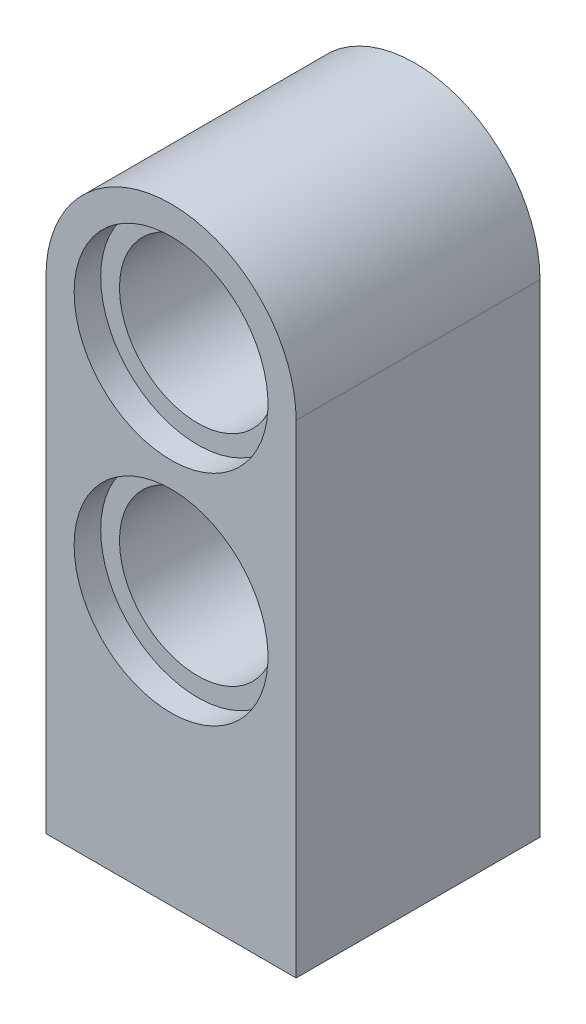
ISO-10303-21;
HEADER;
FILE_DESCRIPTION(('STEP AP214'),'2;1');
FILE_NAME('part.step','',(''),(''),'','','');
FILE_SCHEMA(('AUTOMOTIVE_DESIGN { 1 0 10303 214 1 1 1 1 }'));
ENDSEC;
DATA;
#1=APPLICATION_CONTEXT('core data for automotive mechanical design processes');
#2=APPLICATION_PROTOCOL_DEFINITION('international standard','automotive_design',2000,#1);
#3=PRODUCT_CONTEXT('',#1,'mechanical');
#4=PRODUCT('Part','Part','',(#3));
#5=PRODUCT_RELATED_PRODUCT_CATEGORY('part','',(#4));
#6=PRODUCT_DEFINITION_FORMATION('','',#4);
#7=PRODUCT_DEFINITION_CONTEXT('part definition',#1,'design');
#8=PRODUCT_DEFINITION('design','',#6,#7);
#9=PRODUCT_DEFINITION_SHAPE('','',#8);
#10=(LENGTH_UNIT() NAMED_UNIT(*) SI_UNIT(.MILLI.,.METRE.));
#11=(NAMED_UNIT(*) PLANE_ANGLE_UNIT() SI_UNIT($,.RADIAN.));
#12=(NAMED_UNIT(*) SI_UNIT($,.STERADIAN.) SOLID_ANGLE_UNIT());
#13=UNCERTAINTY_MEASURE_WITH_UNIT(LENGTH_MEASURE(1.E-05),#10,'distance_accuracy_value','');
#14=(GEOMETRIC_REPRESENTATION_CONTEXT(3) GLOBAL_UNCERTAINTY_ASSIGNED_CONTEXT((#13)) GLOBAL_UNIT_ASSIGNED_CONTEXT((#10,
#11,#12)) REPRESENTATION_CONTEXT('',''));
#15=CARTESIAN_POINT('',(0.,0.,0.));
#16=DIRECTION('',(0.,0.,1.));
#17=DIRECTION('',(1.,0.,0.));
#18=AXIS2_PLACEMENT_3D('',#15,#16,#17);
#19=CARTESIAN_POINT('',(0.,9.,3.9));
#20=DIRECTION('',(0.,0.,1.));
#21=DIRECTION('',(1.,0.,0.));
#22=AXIS2_PLACEMENT_3D('',#19,#20,#21);
#23=PLANE('',#22);
#24=CARTESIAN_POINT('',(0.,9.,3.9));
#25=DIRECTION('',(0.,0.,-1.));
#26=DIRECTION('',(-1.,0.,0.));
#27=AXIS2_PLACEMENT_3D('',#24,#25,#26);
#28=CIRCLE('',#27,3.1);
#29=CARTESIAN_POINT('',(-3.1,9.,3.9));
#30=VERTEX_POINT('',#29);
#31=EDGE_CURVE('E221',#30,#30,#28,.T.);
#32=ORIENTED_EDGE('',*,*,#31,.T.);
#33=EDGE_LOOP('',(#32));
#34=FACE_BOUND('',#33,.T.);
#35=CARTESIAN_POINT('',(0.,2.,3.9));
#36=DIRECTION('',(0.,0.,-1.));
#37=DIRECTION('',(-1.,0.,0.));
#38=AXIS2_PLACEMENT_3D('',#35,#36,#37);
#39=CIRCLE('',#38,3.1);
#40=CARTESIAN_POINT('',(-3.1,2.,3.9));
#41=VERTEX_POINT('',#40);
#42=EDGE_CURVE('E218',#41,#41,#39,.T.);
#43=ORIENTED_EDGE('',*,*,#42,.T.);
#44=EDGE_LOOP('',(#43));
#45=FACE_BOUND('',#44,.T.);
#46=DIRECTION('',(0.,-1.,0.));
#47=VECTOR('',#46,1.);
#48=CARTESIAN_POINT('',(-4.,9.,3.9));
#49=LINE('',#48,#47);
#50=CARTESIAN_POINT('',(-4.,9.,3.9));
#51=VERTEX_POINT('',#50);
#52=CARTESIAN_POINT('',(-4.,-6.4432118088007,3.9));
#53=VERTEX_POINT('',#52);
#54=EDGE_CURVE('E105',#51,#53,#49,.T.);
#55=ORIENTED_EDGE('',*,*,#54,.T.);
#56=DIRECTION('',(1.,0.,0.));
#57=VECTOR('',#56,1.);
#58=CARTESIAN_POINT('',(0.,-6.4432118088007,3.9));
#59=LINE('',#58,#57);
#60=CARTESIAN_POINT('',(4.,-6.4432118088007,3.9));
#61=VERTEX_POINT('',#60);
#62=EDGE_CURVE('E95',#53,#61,#59,.T.);
#63=ORIENTED_EDGE('',*,*,#62,.T.);
#64=DIRECTION('',(0.,1.,0.));
#65=VECTOR('',#64,1.);
#66=CARTESIAN_POINT('',(4.,9.,3.9));
#67=LINE('',#66,#65);
#68=CARTESIAN_POINT('',(4.,9.,3.9));
#69=VERTEX_POINT('',#68);
#70=EDGE_CURVE('E103',#61,#69,#67,.T.);
#71=ORIENTED_EDGE('',*,*,#70,.T.);
#72=CARTESIAN_POINT('',(0.,9.,3.9));
#73=DIRECTION('',(0.,0.,1.));
#74=DIRECTION('',(1.,0.,0.));
#75=AXIS2_PLACEMENT_3D('',#72,#73,#74);
#76=CIRCLE('',#75,4.);
#77=EDGE_CURVE('E121',#69,#51,#76,.T.);
#78=ORIENTED_EDGE('',*,*,#77,.T.);
#79=EDGE_LOOP('',(#55,#63,#71,#78));
#80=FACE_BOUND('',#79,.T.);
#81=ADVANCED_FACE('F16',(#34,#45,#80),#23,.T.);
#82=CARTESIAN_POINT('',(0.,9.,-3.9));
#83=DIRECTION('',(0.,0.,1.));
#84=DIRECTION('',(1.,0.,0.));
#85=AXIS2_PLACEMENT_3D('',#82,#83,#84);
#86=PLANE('',#85);
#87=CARTESIAN_POINT('',(0.,2.,-3.9));
#88=DIRECTION('',(0.,0.,-1.));
#89=DIRECTION('',(-1.,0.,0.));
#90=AXIS2_PLACEMENT_3D('',#87,#88,#89);
#91=CIRCLE('',#90,3.1);
#92=CARTESIAN_POINT('',(-3.1,2.,-3.9));
#93=VERTEX_POINT('',#92);
#94=EDGE_CURVE('E154',#93,#93,#91,.T.);
#95=ORIENTED_EDGE('',*,*,#94,.F.);
#96=EDGE_LOOP('',(#95));
#97=FACE_BOUND('',#96,.T.);
#98=CARTESIAN_POINT('',(0.,9.,-3.9));
#99=DIRECTION('',(0.,0.,-1.));
#100=DIRECTION('',(-1.,0.,0.));
#101=AXIS2_PLACEMENT_3D('',#98,#99,#100);
#102=CIRCLE('',#101,3.1);
#103=CARTESIAN_POINT('',(-3.1,9.,-3.9));
#104=VERTEX_POINT('',#103);
#105=EDGE_CURVE('E172',#104,#104,#102,.T.);
#106=ORIENTED_EDGE('',*,*,#105,.F.);
#107=EDGE_LOOP('',(#106));
#108=FACE_BOUND('',#107,.T.);
#109=DIRECTION('',(1.,0.,0.));
#110=VECTOR('',#109,1.);
#111=CARTESIAN_POINT('',(0.,-6.4432118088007,-3.9));
#112=LINE('',#111,#110);
#113=CARTESIAN_POINT('',(-4.,-6.4432118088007,-3.9));
#114=VERTEX_POINT('',#113);
#115=CARTESIAN_POINT('',(4.,-6.4432118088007,-3.9));
#116=VERTEX_POINT('',#115);
#117=EDGE_CURVE('E36',#114,#116,#112,.T.);
#118=ORIENTED_EDGE('',*,*,#117,.F.);
#119=DIRECTION('',(0.,-1.,0.));
#120=VECTOR('',#119,1.);
#121=CARTESIAN_POINT('',(-4.,9.,-3.9));
#122=LINE('',#121,#120);
#123=CARTESIAN_POINT('',(-4.,9.,-3.9));
#124=VERTEX_POINT('',#123);
#125=EDGE_CURVE('E129',#124,#114,#122,.T.);
#126=ORIENTED_EDGE('',*,*,#125,.F.);
#127=CARTESIAN_POINT('',(0.,9.,-3.9));
#128=DIRECTION('',(0.,0.,1.));
#129=DIRECTION('',(1.,0.,0.));
#130=AXIS2_PLACEMENT_3D('',#127,#128,#129);
#131=CIRCLE('',#130,4.);
#132=CARTESIAN_POINT('',(4.,9.,-3.9));
#133=VERTEX_POINT('',#132);
#134=EDGE_CURVE('E125',#133,#124,#131,.T.);
#135=ORIENTED_EDGE('',*,*,#134,.F.);
#136=DIRECTION('',(0.,1.,0.));
#137=VECTOR('',#136,1.);
#138=CARTESIAN_POINT('',(4.,9.,-3.9));
#139=LINE('',#138,#137);
#140=EDGE_CURVE('E134',#116,#133,#139,.T.);
#141=ORIENTED_EDGE('',*,*,#140,.F.);
#142=EDGE_LOOP('',(#118,#126,#135,#141));
#143=FACE_BOUND('',#142,.T.);
#144=ADVANCED_FACE('F242',(#97,#108,#143),#86,.F.);
#145=CARTESIAN_POINT('',(-4.,9.,3.9));
#146=DIRECTION('',(1.,0.,0.));
#147=DIRECTION('',(0.,1.,0.));
#148=AXIS2_PLACEMENT_3D('',#145,#146,#147);
#149=PLANE('',#148);
#150=DIRECTION('',(0.,0.,-1.));
#151=VECTOR('',#150,1.);
#152=CARTESIAN_POINT('',(-4.,-6.4432118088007,3.9));
#153=LINE('',#152,#151);
#154=EDGE_CURVE('E107',#53,#114,#153,.T.);
#155=ORIENTED_EDGE('',*,*,#154,.F.);
#156=ORIENTED_EDGE('',*,*,#54,.F.);
#157=DIRECTION('',(0.,0.,-1.));
#158=VECTOR('',#157,1.);
#159=CARTESIAN_POINT('',(-4.,9.,3.9));
#160=LINE('',#159,#158);
#161=EDGE_CURVE('E25',#51,#124,#160,.T.);
#162=ORIENTED_EDGE('',*,*,#161,.T.);
#163=ORIENTED_EDGE('',*,*,#125,.T.);
#164=EDGE_LOOP('',(#155,#156,#162,#163));
#165=FACE_BOUND('',#164,.T.);
#166=ADVANCED_FACE('F183',(#165),#149,.F.);
#167=CARTESIAN_POINT('',(4.,9.,3.9));
#168=DIRECTION('',(-1.,0.,0.));
#169=DIRECTION('',(0.,-1.,0.));
#170=AXIS2_PLACEMENT_3D('',#167,#168,#169);
#171=PLANE('',#170);
#172=DIRECTION('',(0.,0.,1.));
#173=VECTOR('',#172,1.);
#174=CARTESIAN_POINT('',(4.,-6.4432118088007,3.9));
#175=LINE('',#174,#173);
#176=EDGE_CURVE('E10',#116,#61,#175,.T.);
#177=ORIENTED_EDGE('',*,*,#176,.F.);
#178=ORIENTED_EDGE('',*,*,#140,.T.);
#179=DIRECTION('',(0.,0.,-1.));
#180=VECTOR('',#179,1.);
#181=CARTESIAN_POINT('',(4.,9.,3.9));
#182=LINE('',#181,#180);
#183=EDGE_CURVE('E111',#69,#133,#182,.T.);
#184=ORIENTED_EDGE('',*,*,#183,.F.);
#185=ORIENTED_EDGE('',*,*,#70,.F.);
#186=EDGE_LOOP('',(#177,#178,#184,#185));
#187=FACE_BOUND('',#186,.T.);
#188=ADVANCED_FACE('F109',(#187),#171,.F.);
#189=CARTESIAN_POINT('',(0.,9.,3.9));
#190=DIRECTION('',(0.,0.,-1.));
#191=DIRECTION('',(-1.,0.,0.));
#192=AXIS2_PLACEMENT_3D('',#189,#190,#191);
#193=CYLINDRICAL_SURFACE('',#192,2.5);
#194=CARTESIAN_POINT('',(0.,9.,-3.05));
#195=DIRECTION('',(0.,0.,-1.));
#196=DIRECTION('',(-1.,0.,0.));
#197=AXIS2_PLACEMENT_3D('',#194,#195,#196);
#198=CIRCLE('',#197,2.5);
#199=CARTESIAN_POINT('',(-2.5,9.,-3.05));
#200=VERTEX_POINT('',#199);
#201=EDGE_CURVE('E130',#200,#200,#198,.T.);
#202=ORIENTED_EDGE('',*,*,#201,.T.);
#203=EDGE_LOOP('',(#202));
#204=FACE_BOUND('',#203,.T.);
#205=CARTESIAN_POINT('',(0.,9.,3.05));
#206=DIRECTION('',(0.,0.,1.));
#207=DIRECTION('',(1.,0.,0.));
#208=AXIS2_PLACEMENT_3D('',#205,#206,#207);
#209=CIRCLE('',#208,2.5);
#210=CARTESIAN_POINT('',(2.5,9.,3.05));
#211=VERTEX_POINT('',#210);
#212=EDGE_CURVE('E150',#211,#211,#209,.T.);
#213=ORIENTED_EDGE('',*,*,#212,.T.);
#214=EDGE_LOOP('',(#213));
#215=FACE_BOUND('',#214,.T.);
#216=ADVANCED_FACE('F261',(#204,#215),#193,.F.);
#217=CARTESIAN_POINT('',(0.,2.,3.9));
#218=DIRECTION('',(0.,0.,-1.));
#219=DIRECTION('',(-1.,0.,0.));
#220=AXIS2_PLACEMENT_3D('',#217,#218,#219);
#221=CYLINDRICAL_SURFACE('',#220,2.5);
#222=CARTESIAN_POINT('',(0.,2.,-1.61270993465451));
#223=DIRECTION('',(-0.604572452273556,0.5,0.62007431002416));
#224=DIRECTION('',(-0.477832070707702,0.395181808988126,-0.784543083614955));
#225=AXIS2_PLACEMENT_3D('',#222,#223,#224);
#226=ELLIPSE('',#225,4.03177483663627,2.5);
#227=CARTESIAN_POINT('',(-0.536085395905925,-0.441846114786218,-0.166398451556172));
#228=VERTEX_POINT('',#227);
#229=CARTESIAN_POINT('',(0.158503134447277,-0.494970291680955,0.553662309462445));
#230=VERTEX_POINT('',#229);
#231=EDGE_CURVE('E209',#228,#230,#226,.T.);
#232=ORIENTED_EDGE('',*,*,#231,.F.);
#233=CARTESIAN_POINT('',(0.,2.,-0.716229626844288));
#234=DIRECTION('',(-0.716000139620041,0.,-0.69810013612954));
#235=DIRECTION('',(0.69810013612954,0.,-0.716000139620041));
#236=AXIS2_PLACEMENT_3D('',#233,#234,#235);
#237=ELLIPSE('',#236,3.58114813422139,2.5);
#238=CARTESIAN_POINT('',(-0.158503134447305,-0.494970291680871,-0.553662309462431));
#239=VERTEX_POINT('',#238);
#240=EDGE_CURVE('E215',#239,#228,#237,.T.);
#241=ORIENTED_EDGE('',*,*,#240,.F.);
#242=CARTESIAN_POINT('',(0.,2.,1.61270993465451));
#243=DIRECTION('',(-0.604572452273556,-0.5,0.62007431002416));
#244=DIRECTION('',(-0.477832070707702,-0.395181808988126,-0.784543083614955));
#245=AXIS2_PLACEMENT_3D('',#242,#243,#244);
#246=ELLIPSE('',#245,4.03177483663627,2.5);
#247=CARTESIAN_POINT('',(0.53608539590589,-0.441846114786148,0.166398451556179));
#248=VERTEX_POINT('',#247);
#249=EDGE_CURVE('E205',#239,#248,#246,.T.);
#250=ORIENTED_EDGE('',*,*,#249,.T.);
#251=CARTESIAN_POINT('',(0.,2.,0.716229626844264));
#252=DIRECTION('',(0.716000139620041,0.,0.69810013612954));
#253=DIRECTION('',(0.69810013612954,0.,-0.716000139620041));
#254=AXIS2_PLACEMENT_3D('',#251,#252,#253);
#255=ELLIPSE('',#254,3.58114813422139,2.5);
#256=EDGE_CURVE('E212',#230,#248,#255,.T.);
#257=ORIENTED_EDGE('',*,*,#256,.F.);
#258=EDGE_LOOP('',(#232,#241,#250,#257));
#259=FACE_BOUND('',#258,.T.);
#260=CARTESIAN_POINT('',(0.,2.,-3.05));
#261=DIRECTION('',(0.,0.,-1.));
#262=DIRECTION('',(-1.,0.,0.));
#263=AXIS2_PLACEMENT_3D('',#260,#261,#262);
#264=CIRCLE('',#263,2.5);
#265=CARTESIAN_POINT('',(-2.5,2.,-3.05));
#266=VERTEX_POINT('',#265);
#267=EDGE_CURVE('E139',#266,#266,#264,.T.);
#268=ORIENTED_EDGE('',*,*,#267,.T.);
#269=EDGE_LOOP('',(#268));
#270=FACE_BOUND('',#269,.T.);
#271=CARTESIAN_POINT('',(0.,2.,3.05));
#272=DIRECTION('',(0.,0.,1.));
#273=DIRECTION('',(1.,0.,0.));
#274=AXIS2_PLACEMENT_3D('',#271,#272,#273);
#275=CIRCLE('',#274,2.5);
#276=CARTESIAN_POINT('',(2.5,2.,3.05));
#277=VERTEX_POINT('',#276);
#278=EDGE_CURVE('E147',#277,#277,#275,.T.);
#279=ORIENTED_EDGE('',*,*,#278,.T.);
#280=EDGE_LOOP('',(#279));
#281=FACE_BOUND('',#280,.T.);
#282=ADVANCED_FACE('F265',(#259,#270,#281),#221,.F.);
#283=CARTESIAN_POINT('',(0.,9.,3.9));
#284=DIRECTION('',(0.,0.,-1.));
#285=DIRECTION('',(-1.,0.,0.));
#286=AXIS2_PLACEMENT_3D('',#283,#284,#285);
#287=CYLINDRICAL_SURFACE('',#286,4.);
#288=ORIENTED_EDGE('',*,*,#134,.T.);
#289=ORIENTED_EDGE('',*,*,#161,.F.);
#290=ORIENTED_EDGE('',*,*,#77,.F.);
#291=ORIENTED_EDGE('',*,*,#183,.T.);
#292=EDGE_LOOP('',(#288,#289,#290,#291));
#293=FACE_BOUND('',#292,.T.);
#294=ADVANCED_FACE('F18',(#293),#287,.T.);
#295=CARTESIAN_POINT('',(0.,2.,-3.05));
#296=DIRECTION('',(0.,0.,-1.));
#297=DIRECTION('',(-1.,0.,0.));
#298=AXIS2_PLACEMENT_3D('',#295,#296,#297);
#299=CYLINDRICAL_SURFACE('',#298,3.1);
#300=CARTESIAN_POINT('',(0.,2.,-3.05));
#301=DIRECTION('',(0.,0.,-1.));
#302=DIRECTION('',(-1.,0.,0.));
#303=AXIS2_PLACEMENT_3D('',#300,#301,#302);
#304=CIRCLE('',#303,3.1);
#305=CARTESIAN_POINT('',(-3.1,2.,-3.05));
#306=VERTEX_POINT('',#305);
#307=EDGE_CURVE('E163',#306,#306,#304,.T.);
#308=ORIENTED_EDGE('',*,*,#307,.F.);
#309=EDGE_LOOP('',(#308));
#310=FACE_BOUND('',#309,.T.);
#311=ORIENTED_EDGE('',*,*,#94,.T.);
#312=EDGE_LOOP('',(#311));
#313=FACE_BOUND('',#312,.T.);
#314=ADVANCED_FACE('F273',(#310,#313),#299,.F.);
#315=CARTESIAN_POINT('',(0.,2.,-3.05));
#316=DIRECTION('',(0.,0.,-1.));
#317=DIRECTION('',(-1.,0.,0.));
#318=AXIS2_PLACEMENT_3D('',#315,#316,#317);
#319=PLANE('',#318);
#320=ORIENTED_EDGE('',*,*,#267,.F.);
#321=EDGE_LOOP('',(#320));
#322=FACE_BOUND('',#321,.T.);
#323=ORIENTED_EDGE('',*,*,#307,.T.);
#324=EDGE_LOOP('',(#323));
#325=FACE_BOUND('',#324,.T.);
#326=ADVANCED_FACE('F276',(#322,#325),#319,.T.);
#327=CARTESIAN_POINT('',(0.,9.,-3.05));
#328=DIRECTION('',(0.,0.,-1.));
#329=DIRECTION('',(-1.,0.,0.));
#330=AXIS2_PLACEMENT_3D('',#327,#328,#329);
#331=CYLINDRICAL_SURFACE('',#330,3.1);
#332=CARTESIAN_POINT('',(0.,9.,-3.05));
#333=DIRECTION('',(0.,0.,-1.));
#334=DIRECTION('',(-1.,0.,0.));
#335=AXIS2_PLACEMENT_3D('',#332,#333,#334);
#336=CIRCLE('',#335,3.1);
#337=CARTESIAN_POINT('',(-3.1,9.,-3.05));
#338=VERTEX_POINT('',#337);
#339=EDGE_CURVE('E143',#338,#338,#336,.T.);
#340=ORIENTED_EDGE('',*,*,#339,.F.);
#341=EDGE_LOOP('',(#340));
#342=FACE_BOUND('',#341,.T.);
#343=ORIENTED_EDGE('',*,*,#105,.T.);
#344=EDGE_LOOP('',(#343));
#345=FACE_BOUND('',#344,.T.);
#346=ADVANCED_FACE('F240',(#342,#345),#331,.F.);
#347=CARTESIAN_POINT('',(0.,9.,-3.05));
#348=DIRECTION('',(0.,0.,-1.));
#349=DIRECTION('',(-1.,0.,0.));
#350=AXIS2_PLACEMENT_3D('',#347,#348,#349);
#351=PLANE('',#350);
#352=ORIENTED_EDGE('',*,*,#201,.F.);
#353=EDGE_LOOP('',(#352));
#354=FACE_BOUND('',#353,.T.);
#355=ORIENTED_EDGE('',*,*,#339,.T.);
#356=EDGE_LOOP('',(#355));
#357=FACE_BOUND('',#356,.T.);
#358=ADVANCED_FACE('F283',(#354,#357),#351,.T.);
#359=CARTESIAN_POINT('',(0.,2.,3.05));
#360=DIRECTION('',(0.,0.,1.));
#361=DIRECTION('',(1.,0.,0.));
#362=AXIS2_PLACEMENT_3D('',#359,#360,#361);
#363=CYLINDRICAL_SURFACE('',#362,3.1);
#364=CARTESIAN_POINT('',(0.,2.,3.05));
#365=DIRECTION('',(0.,0.,-1.));
#366=DIRECTION('',(-1.,0.,0.));
#367=AXIS2_PLACEMENT_3D('',#364,#365,#366);
#368=CIRCLE('',#367,3.1);
#369=CARTESIAN_POINT('',(-3.1,2.,3.05));
#370=VERTEX_POINT('',#369);
#371=EDGE_CURVE('E224',#370,#370,#368,.T.);
#372=ORIENTED_EDGE('',*,*,#371,.T.);
#373=EDGE_LOOP('',(#372));
#374=FACE_BOUND('',#373,.T.);
#375=ORIENTED_EDGE('',*,*,#42,.F.);
#376=EDGE_LOOP('',(#375));
#377=FACE_BOUND('',#376,.T.);
#378=ADVANCED_FACE('F287',(#374,#377),#363,.F.);
#379=CARTESIAN_POINT('',(0.,2.,3.05));
#380=DIRECTION('',(0.,0.,1.));
#381=DIRECTION('',(-1.,0.,0.));
#382=AXIS2_PLACEMENT_3D('',#379,#380,#381);
#383=PLANE('',#382);
#384=ORIENTED_EDGE('',*,*,#278,.F.);
#385=EDGE_LOOP('',(#384));
#386=FACE_BOUND('',#385,.T.);
#387=ORIENTED_EDGE('',*,*,#371,.F.);
#388=EDGE_LOOP('',(#387));
#389=FACE_BOUND('',#388,.T.);
#390=ADVANCED_FACE('F291',(#386,#389),#383,.T.);
#391=CARTESIAN_POINT('',(0.,9.,3.05));
#392=DIRECTION('',(0.,0.,1.));
#393=DIRECTION('',(1.,0.,0.));
#394=AXIS2_PLACEMENT_3D('',#391,#392,#393);
#395=CYLINDRICAL_SURFACE('',#394,3.1);
#396=CARTESIAN_POINT('',(0.,9.,3.05));
#397=DIRECTION('',(0.,0.,-1.));
#398=DIRECTION('',(-1.,0.,0.));
#399=AXIS2_PLACEMENT_3D('',#396,#397,#398);
#400=CIRCLE('',#399,3.1);
#401=CARTESIAN_POINT('',(-3.1,9.,3.05));
#402=VERTEX_POINT('',#401);
#403=EDGE_CURVE('E151',#402,#402,#400,.T.);
#404=ORIENTED_EDGE('',*,*,#403,.T.);
#405=EDGE_LOOP('',(#404));
#406=FACE_BOUND('',#405,.T.);
#407=ORIENTED_EDGE('',*,*,#31,.F.);
#408=EDGE_LOOP('',(#407));
#409=FACE_BOUND('',#408,.T.);
#410=ADVANCED_FACE('F295',(#406,#409),#395,.F.);
#411=CARTESIAN_POINT('',(0.,9.,3.05));
#412=DIRECTION('',(0.,0.,1.));
#413=DIRECTION('',(-1.,0.,0.));
#414=AXIS2_PLACEMENT_3D('',#411,#412,#413);
#415=PLANE('',#414);
#416=ORIENTED_EDGE('',*,*,#212,.F.);
#417=EDGE_LOOP('',(#416));
#418=FACE_BOUND('',#417,.T.);
#419=ORIENTED_EDGE('',*,*,#403,.F.);
#420=EDGE_LOOP('',(#419));
#421=FACE_BOUND('',#420,.T.);
#422=ADVANCED_FACE('F299',(#418,#421),#415,.T.);
#423=CARTESIAN_POINT('',(-41.5280080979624,-103.923048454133,43.3090584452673));
#424=DIRECTION('',(0.716000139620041,0.,0.69810013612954));
#425=DIRECTION('',(0.69810013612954,0.,-0.716000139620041));
#426=AXIS2_PLACEMENT_3D('',#423,#424,#425);
#427=PLANE('',#426);
#428=DIRECTION('',(-0.349050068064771,-0.866025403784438,0.358000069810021));
#429=VECTOR('',#428,1.);
#430=CARTESIAN_POINT('',(-41.5280080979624,-103.923048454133,43.3090584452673));
#431=LINE('',#430,#429);
#432=CARTESIAN_POINT('',(0.358000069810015,0.,0.349050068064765));
#433=VERTEX_POINT('',#432);
#434=EDGE_CURVE('E202',#433,#230,#431,.T.);
#435=ORIENTED_EDGE('',*,*,#434,.T.);
#436=ORIENTED_EDGE('',*,*,#256,.T.);
#437=DIRECTION('',(0.349050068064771,-0.866025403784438,-0.358000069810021));
#438=VECTOR('',#437,1.);
#439=CARTESIAN_POINT('',(42.2440082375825,-103.923048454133,-42.6109583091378));
#440=LINE('',#439,#438);
#441=EDGE_CURVE('E49',#433,#248,#440,.T.);
#442=ORIENTED_EDGE('',*,*,#441,.F.);
#443=EDGE_LOOP('',(#435,#436,#442));
#444=FACE_BOUND('',#443,.T.);
#445=ADVANCED_FACE('F303',(#444),#427,.T.);
#446=CARTESIAN_POINT('',(0.,0.,0.));
#447=DIRECTION('',(-0.604572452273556,0.5,0.62007431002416));
#448=DIRECTION('',(0.716000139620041,0.,0.69810013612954));
#449=AXIS2_PLACEMENT_3D('',#446,#447,#448);
#450=PLANE('',#449);
#451=DIRECTION('',(0.349050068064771,0.866025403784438,-0.358000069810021));
#452=VECTOR('',#451,1.);
#453=CARTESIAN_POINT('',(-42.2440082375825,-103.923048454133,42.6109583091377));
#454=LINE('',#453,#452);
#455=CARTESIAN_POINT('',(-0.358000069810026,0.,-0.349050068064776));
#456=VERTEX_POINT('',#455);
#457=EDGE_CURVE('E196',#228,#456,#454,.T.);
#458=ORIENTED_EDGE('',*,*,#457,.F.);
#459=ORIENTED_EDGE('',*,*,#231,.T.);
#460=ORIENTED_EDGE('',*,*,#434,.F.);
#461=DIRECTION('',(0.716000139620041,0.,0.69810013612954));
#462=VECTOR('',#461,1.);
#463=CARTESIAN_POINT('',(0.358000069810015,0.,0.349050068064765));
#464=LINE('',#463,#462);
#465=EDGE_CURVE('E199',#456,#433,#464,.T.);
#466=ORIENTED_EDGE('',*,*,#465,.F.);
#467=EDGE_LOOP('',(#458,#459,#460,#466));
#468=FACE_BOUND('',#467,.T.);
#469=ADVANCED_FACE('F307',(#468),#450,.T.);
#470=CARTESIAN_POINT('',(-42.2440082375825,-103.923048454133,42.6109583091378));
#471=DIRECTION('',(-0.716000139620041,0.,-0.69810013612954));
#472=DIRECTION('',(-0.69810013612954,0.,0.716000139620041));
#473=AXIS2_PLACEMENT_3D('',#470,#471,#472);
#474=PLANE('',#473);
#475=DIRECTION('',(-0.349050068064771,0.866025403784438,0.358000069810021));
#476=VECTOR('',#475,1.);
#477=CARTESIAN_POINT('',(41.5280080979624,-103.923048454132,-43.3090584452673));
#478=LINE('',#477,#476);
#479=EDGE_CURVE('E185',#239,#456,#478,.T.);
#480=ORIENTED_EDGE('',*,*,#479,.F.);
#481=ORIENTED_EDGE('',*,*,#240,.T.);
#482=ORIENTED_EDGE('',*,*,#457,.T.);
#483=EDGE_LOOP('',(#480,#481,#482));
#484=FACE_BOUND('',#483,.T.);
#485=ADVANCED_FACE('F309',(#484),#474,.T.);
#486=CARTESIAN_POINT('',(0.,0.,0.));
#487=DIRECTION('',(-0.604572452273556,-0.5,0.62007431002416));
#488=DIRECTION('',(0.716000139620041,0.,0.69810013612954));
#489=AXIS2_PLACEMENT_3D('',#486,#487,#488);
#490=PLANE('',#489);
#491=ORIENTED_EDGE('',*,*,#249,.F.);
#492=ORIENTED_EDGE('',*,*,#479,.T.);
#493=ORIENTED_EDGE('',*,*,#465,.T.);
#494=ORIENTED_EDGE('',*,*,#441,.T.);
#495=EDGE_LOOP('',(#491,#492,#493,#494));
#496=FACE_BOUND('',#495,.T.);
#497=ADVANCED_FACE('F312',(#496),#490,.F.);
#498=CARTESIAN_POINT('',(0.966047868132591,-6.4432118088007,-50.8));
#499=DIRECTION('',(0.,-1.,0.));
#500=DIRECTION('',(0.,0.,-1.));
#501=AXIS2_PLACEMENT_3D('',#498,#499,#500);
#502=PLANE('',#501);
#503=ORIENTED_EDGE('',*,*,#154,.T.);
#504=ORIENTED_EDGE('',*,*,#117,.T.);
#505=ORIENTED_EDGE('',*,*,#176,.T.);
#506=ORIENTED_EDGE('',*,*,#62,.F.);
#507=EDGE_LOOP('',(#503,#504,#505,#506));
#508=FACE_BOUND('',#507,.T.);
#509=ADVANCED_FACE('F94',(#508),#502,.T.);
#510=CLOSED_SHELL('',(#81,#144,#166,#188,#216,#282,#294,#314,#326,#346,#358,#378,#390,#410,#422,
#445,#469,#485,#497,#509));
#511=MANIFOLD_SOLID_BREP('B1',#510);
#512=ADVANCED_BREP_SHAPE_REPRESENTATION('',(#18,#511),#14);
#513=SHAPE_DEFINITION_REPRESENTATION(#9,#512);
ENDSEC;
END-ISO-10303-21;
